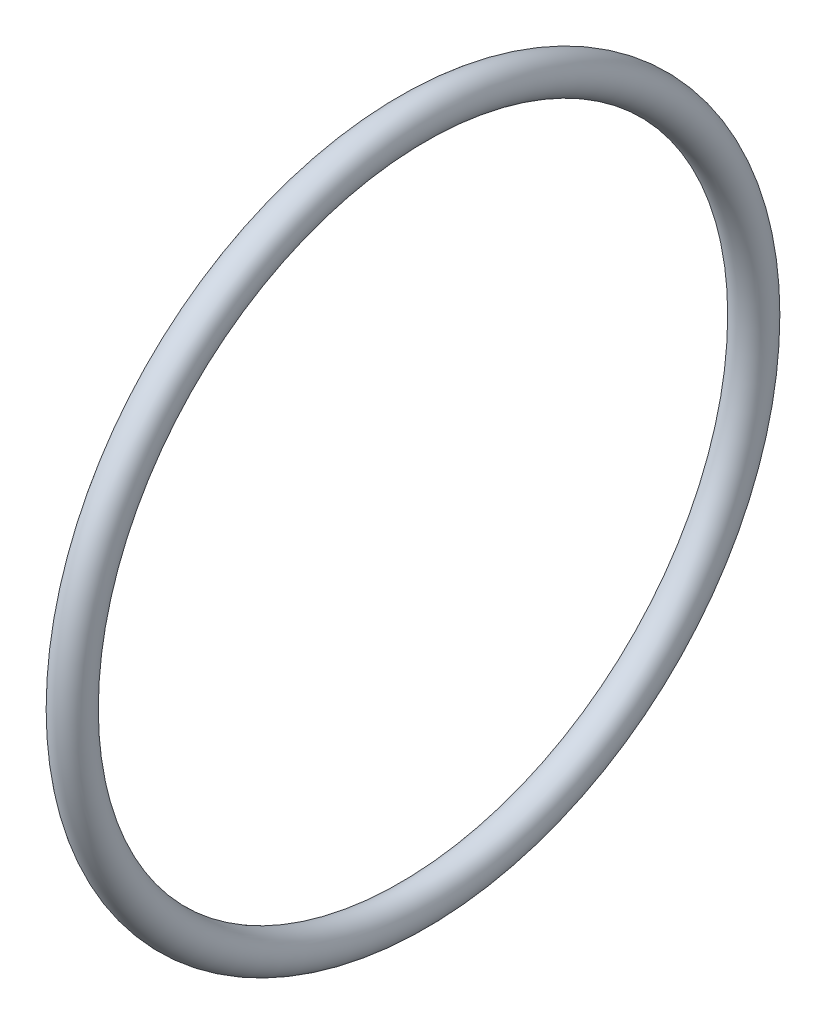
from build123d import *

# Parameters (mm, degrees)
SKETCH1_R = 1.3081


with BuildPart() as part:
    # Sketch1 → Base-Revolve (revolve)
    with BuildSketch(Plane.XY, mode=Mode.PRIVATE) as base_revolve_sk:
        with Locations((0, 24.1554)):
            Circle(SKETCH1_R)
    revolve(base_revolve_sk.sketch.rotate(Axis((0, 0, 0), (1, 0, 0)), 90), axis=Axis((0, 0, 0), (1, 0, 0)))


solid = part.part
